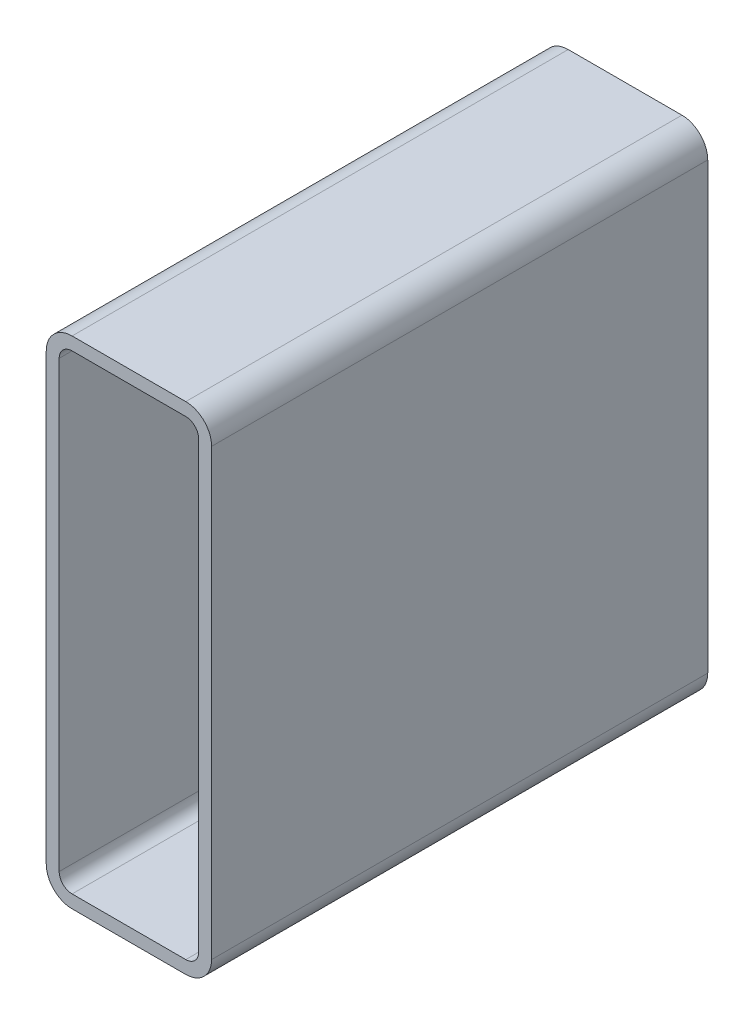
ISO-10303-21;
HEADER;
FILE_DESCRIPTION(('STEP AP214'),'2;1');
FILE_NAME('part.step','',(''),(''),'','','');
FILE_SCHEMA(('AUTOMOTIVE_DESIGN { 1 0 10303 214 1 1 1 1 }'));
ENDSEC;
DATA;
#1=APPLICATION_CONTEXT('core data for automotive mechanical design processes');
#2=APPLICATION_PROTOCOL_DEFINITION('international standard','automotive_design',2000,#1);
#3=PRODUCT_CONTEXT('',#1,'mechanical');
#4=PRODUCT('Part','Part','',(#3));
#5=PRODUCT_RELATED_PRODUCT_CATEGORY('part','',(#4));
#6=PRODUCT_DEFINITION_FORMATION('','',#4);
#7=PRODUCT_DEFINITION_CONTEXT('part definition',#1,'design');
#8=PRODUCT_DEFINITION('design','',#6,#7);
#9=PRODUCT_DEFINITION_SHAPE('','',#8);
#10=(LENGTH_UNIT() NAMED_UNIT(*) SI_UNIT(.MILLI.,.METRE.));
#11=(NAMED_UNIT(*) PLANE_ANGLE_UNIT() SI_UNIT($,.RADIAN.));
#12=(NAMED_UNIT(*) SI_UNIT($,.STERADIAN.) SOLID_ANGLE_UNIT());
#13=UNCERTAINTY_MEASURE_WITH_UNIT(LENGTH_MEASURE(1.E-05),#10,'distance_accuracy_value','');
#14=(GEOMETRIC_REPRESENTATION_CONTEXT(3) GLOBAL_UNCERTAINTY_ASSIGNED_CONTEXT((#13)) GLOBAL_UNIT_ASSIGNED_CONTEXT((#10,
#11,#12)) REPRESENTATION_CONTEXT('',''));
#15=CARTESIAN_POINT('',(0.,0.,0.));
#16=DIRECTION('',(0.,0.,1.));
#17=DIRECTION('',(1.,0.,0.));
#18=AXIS2_PLACEMENT_3D('',#15,#16,#17);
#19=CARTESIAN_POINT('',(17.5501778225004,290.799496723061,304.8));
#20=DIRECTION('',(0.,0.,1.));
#21=DIRECTION('',(1.,0.,0.));
#22=AXIS2_PLACEMENT_3D('',#19,#20,#21);
#23=PLANE('',#22);
#24=CARTESIAN_POINT('',(17.5501778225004,290.799496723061,304.8));
#25=DIRECTION('',(0.,0.,1.));
#26=DIRECTION('',(1.,0.,0.));
#27=AXIS2_PLACEMENT_3D('',#24,#25,#26);
#28=CIRCLE('',#27,15.875);
#29=CARTESIAN_POINT('',(17.5501778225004,306.674496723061,304.8));
#30=VERTEX_POINT('',#29);
#31=CARTESIAN_POINT('',(1.67517782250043,290.799496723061,304.8));
#32=VERTEX_POINT('',#31);
#33=EDGE_CURVE('E211',#30,#32,#28,.T.);
#34=ORIENTED_EDGE('',*,*,#33,.T.);
#35=DIRECTION('',(0.,-1.,0.));
#36=VECTOR('',#35,1.);
#37=CARTESIAN_POINT('',(1.67517782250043,17.7494967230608,304.8));
#38=LINE('',#37,#36);
#39=CARTESIAN_POINT('',(1.67517782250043,17.7494967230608,304.8));
#40=VERTEX_POINT('',#39);
#41=EDGE_CURVE('E214',#32,#40,#38,.T.);
#42=ORIENTED_EDGE('',*,*,#41,.T.);
#43=CARTESIAN_POINT('',(17.5501778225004,17.7494967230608,304.8));
#44=DIRECTION('',(0.,0.,1.));
#45=DIRECTION('',(1.,0.,0.));
#46=AXIS2_PLACEMENT_3D('',#43,#44,#45);
#47=CIRCLE('',#46,15.875);
#48=CARTESIAN_POINT('',(17.5501778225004,1.87449672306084,304.8));
#49=VERTEX_POINT('',#48);
#50=EDGE_CURVE('E217',#40,#49,#47,.T.);
#51=ORIENTED_EDGE('',*,*,#50,.T.);
#52=DIRECTION('',(1.,0.,0.));
#53=VECTOR('',#52,1.);
#54=CARTESIAN_POINT('',(87.4001778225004,1.87449672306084,304.8));
#55=LINE('',#54,#53);
#56=CARTESIAN_POINT('',(87.4001778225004,1.87449672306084,304.8));
#57=VERTEX_POINT('',#56);
#58=EDGE_CURVE('E219',#49,#57,#55,.T.);
#59=ORIENTED_EDGE('',*,*,#58,.T.);
#60=CARTESIAN_POINT('',(87.4001778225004,17.7494967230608,304.8));
#61=DIRECTION('',(0.,0.,1.));
#62=DIRECTION('',(1.,0.,0.));
#63=AXIS2_PLACEMENT_3D('',#60,#61,#62);
#64=CIRCLE('',#63,15.875);
#65=CARTESIAN_POINT('',(103.2751778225,17.7494967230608,304.8));
#66=VERTEX_POINT('',#65);
#67=EDGE_CURVE('E221',#57,#66,#64,.T.);
#68=ORIENTED_EDGE('',*,*,#67,.T.);
#69=DIRECTION('',(0.,1.,0.));
#70=VECTOR('',#69,1.);
#71=CARTESIAN_POINT('',(103.2751778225,290.799496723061,304.8));
#72=LINE('',#71,#70);
#73=CARTESIAN_POINT('',(103.2751778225,290.799496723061,304.8));
#74=VERTEX_POINT('',#73);
#75=EDGE_CURVE('E223',#66,#74,#72,.T.);
#76=ORIENTED_EDGE('',*,*,#75,.T.);
#77=CARTESIAN_POINT('',(87.4001778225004,290.799496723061,304.8));
#78=DIRECTION('',(0.,0.,1.));
#79=DIRECTION('',(1.,0.,0.));
#80=AXIS2_PLACEMENT_3D('',#77,#78,#79);
#81=CIRCLE('',#80,15.875);
#82=CARTESIAN_POINT('',(87.4001778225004,306.674496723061,304.8));
#83=VERTEX_POINT('',#82);
#84=EDGE_CURVE('E225',#74,#83,#81,.T.);
#85=ORIENTED_EDGE('',*,*,#84,.T.);
#86=DIRECTION('',(-1.,0.,0.));
#87=VECTOR('',#86,1.);
#88=CARTESIAN_POINT('',(17.5501778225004,306.674496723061,304.8));
#89=LINE('',#88,#87);
#90=EDGE_CURVE('E227',#83,#30,#89,.T.);
#91=ORIENTED_EDGE('',*,*,#90,.T.);
#92=EDGE_LOOP('',(#34,#42,#51,#59,#68,#76,#85,#91));
#93=FACE_BOUND('',#92,.T.);
#94=DIRECTION('',(0.,-1.,0.));
#95=VECTOR('',#94,1.);
#96=CARTESIAN_POINT('',(9.61267782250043,17.7494967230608,304.8));
#97=LINE('',#96,#95);
#98=CARTESIAN_POINT('',(9.61267782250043,290.799496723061,304.8));
#99=VERTEX_POINT('',#98);
#100=CARTESIAN_POINT('',(9.61267782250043,17.7494967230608,304.8));
#101=VERTEX_POINT('',#100);
#102=EDGE_CURVE('E154',#99,#101,#97,.T.);
#103=ORIENTED_EDGE('',*,*,#102,.F.);
#104=CARTESIAN_POINT('',(17.5501778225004,290.799496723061,304.8));
#105=DIRECTION('',(0.,0.,1.));
#106=DIRECTION('',(1.,0.,0.));
#107=AXIS2_PLACEMENT_3D('',#104,#105,#106);
#108=CIRCLE('',#107,7.9375);
#109=CARTESIAN_POINT('',(17.5501778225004,298.736996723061,304.8));
#110=VERTEX_POINT('',#109);
#111=EDGE_CURVE('E146',#110,#99,#108,.T.);
#112=ORIENTED_EDGE('',*,*,#111,.F.);
#113=DIRECTION('',(-1.,0.,0.));
#114=VECTOR('',#113,1.);
#115=CARTESIAN_POINT('',(17.5501778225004,298.736996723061,304.8));
#116=LINE('',#115,#114);
#117=CARTESIAN_POINT('',(87.4001778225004,298.736996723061,304.8));
#118=VERTEX_POINT('',#117);
#119=EDGE_CURVE('E179',#118,#110,#116,.T.);
#120=ORIENTED_EDGE('',*,*,#119,.F.);
#121=CARTESIAN_POINT('',(87.4001778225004,290.799496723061,304.8));
#122=DIRECTION('',(0.,0.,1.));
#123=DIRECTION('',(1.,0.,0.));
#124=AXIS2_PLACEMENT_3D('',#121,#122,#123);
#125=CIRCLE('',#124,7.93749999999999);
#126=CARTESIAN_POINT('',(95.3376778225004,290.799496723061,304.8));
#127=VERTEX_POINT('',#126);
#128=EDGE_CURVE('E177',#127,#118,#125,.T.);
#129=ORIENTED_EDGE('',*,*,#128,.F.);
#130=DIRECTION('',(0.,1.,0.));
#131=VECTOR('',#130,1.);
#132=CARTESIAN_POINT('',(95.3376778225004,290.799496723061,304.8));
#133=LINE('',#132,#131);
#134=CARTESIAN_POINT('',(95.3376778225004,17.7494967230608,304.8));
#135=VERTEX_POINT('',#134);
#136=EDGE_CURVE('E175',#135,#127,#133,.T.);
#137=ORIENTED_EDGE('',*,*,#136,.F.);
#138=CARTESIAN_POINT('',(87.4001778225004,17.7494967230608,304.8));
#139=DIRECTION('',(0.,0.,1.));
#140=DIRECTION('',(1.,0.,0.));
#141=AXIS2_PLACEMENT_3D('',#138,#139,#140);
#142=CIRCLE('',#141,7.9375);
#143=CARTESIAN_POINT('',(87.4001778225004,9.81199672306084,304.8));
#144=VERTEX_POINT('',#143);
#145=EDGE_CURVE('E173',#144,#135,#142,.T.);
#146=ORIENTED_EDGE('',*,*,#145,.F.);
#147=DIRECTION('',(1.,0.,0.));
#148=VECTOR('',#147,1.);
#149=CARTESIAN_POINT('',(87.4001778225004,9.81199672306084,304.8));
#150=LINE('',#149,#148);
#151=CARTESIAN_POINT('',(17.5501778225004,9.81199672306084,304.8));
#152=VERTEX_POINT('',#151);
#153=EDGE_CURVE('E169',#152,#144,#150,.T.);
#154=ORIENTED_EDGE('',*,*,#153,.F.);
#155=CARTESIAN_POINT('',(17.5501778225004,17.7494967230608,304.8));
#156=DIRECTION('',(0.,0.,1.));
#157=DIRECTION('',(1.,0.,0.));
#158=AXIS2_PLACEMENT_3D('',#155,#156,#157);
#159=CIRCLE('',#158,7.9375);
#160=EDGE_CURVE('E167',#101,#152,#159,.T.);
#161=ORIENTED_EDGE('',*,*,#160,.F.);
#162=EDGE_LOOP('',(#103,#112,#120,#129,#137,#146,#154,#161));
#163=FACE_BOUND('',#162,.T.);
#164=ADVANCED_FACE('F33',(#93,#163),#23,.T.);
#165=CARTESIAN_POINT('',(17.5501778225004,290.799496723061,0.));
#166=DIRECTION('',(0.,0.,1.));
#167=DIRECTION('',(1.,0.,0.));
#168=AXIS2_PLACEMENT_3D('',#165,#166,#167);
#169=PLANE('',#168);
#170=CARTESIAN_POINT('',(17.5501778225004,290.799496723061,0.));
#171=DIRECTION('',(0.,0.,1.));
#172=DIRECTION('',(1.,0.,0.));
#173=AXIS2_PLACEMENT_3D('',#170,#171,#172);
#174=CIRCLE('',#173,15.875);
#175=CARTESIAN_POINT('',(17.5501778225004,306.674496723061,0.));
#176=VERTEX_POINT('',#175);
#177=CARTESIAN_POINT('',(1.67517782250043,290.799496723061,0.));
#178=VERTEX_POINT('',#177);
#179=EDGE_CURVE('E162',#176,#178,#174,.T.);
#180=ORIENTED_EDGE('',*,*,#179,.F.);
#181=DIRECTION('',(-1.,0.,0.));
#182=VECTOR('',#181,1.);
#183=CARTESIAN_POINT('',(17.5501778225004,306.674496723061,0.));
#184=LINE('',#183,#182);
#185=CARTESIAN_POINT('',(87.4001778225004,306.674496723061,0.));
#186=VERTEX_POINT('',#185);
#187=EDGE_CURVE('E215',#186,#176,#184,.T.);
#188=ORIENTED_EDGE('',*,*,#187,.F.);
#189=CARTESIAN_POINT('',(87.4001778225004,290.799496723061,0.));
#190=DIRECTION('',(0.,0.,1.));
#191=DIRECTION('',(1.,0.,0.));
#192=AXIS2_PLACEMENT_3D('',#189,#190,#191);
#193=CIRCLE('',#192,15.875);
#194=CARTESIAN_POINT('',(103.2751778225,290.799496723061,0.));
#195=VERTEX_POINT('',#194);
#196=EDGE_CURVE('E242',#195,#186,#193,.T.);
#197=ORIENTED_EDGE('',*,*,#196,.F.);
#198=DIRECTION('',(0.,1.,0.));
#199=VECTOR('',#198,1.);
#200=CARTESIAN_POINT('',(103.2751778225,290.799496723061,0.));
#201=LINE('',#200,#199);
#202=CARTESIAN_POINT('',(103.2751778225,17.7494967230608,0.));
#203=VERTEX_POINT('',#202);
#204=EDGE_CURVE('E240',#203,#195,#201,.T.);
#205=ORIENTED_EDGE('',*,*,#204,.F.);
#206=CARTESIAN_POINT('',(87.4001778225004,17.7494967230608,0.));
#207=DIRECTION('',(0.,0.,1.));
#208=DIRECTION('',(1.,0.,0.));
#209=AXIS2_PLACEMENT_3D('',#206,#207,#208);
#210=CIRCLE('',#209,15.875);
#211=CARTESIAN_POINT('',(87.4001778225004,1.87449672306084,0.));
#212=VERTEX_POINT('',#211);
#213=EDGE_CURVE('E238',#212,#203,#210,.T.);
#214=ORIENTED_EDGE('',*,*,#213,.F.);
#215=DIRECTION('',(1.,0.,0.));
#216=VECTOR('',#215,1.);
#217=CARTESIAN_POINT('',(87.4001778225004,1.87449672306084,0.));
#218=LINE('',#217,#216);
#219=CARTESIAN_POINT('',(17.5501778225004,1.87449672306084,0.));
#220=VERTEX_POINT('',#219);
#221=EDGE_CURVE('E236',#220,#212,#218,.T.);
#222=ORIENTED_EDGE('',*,*,#221,.F.);
#223=CARTESIAN_POINT('',(17.5501778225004,17.7494967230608,0.));
#224=DIRECTION('',(0.,0.,1.));
#225=DIRECTION('',(1.,0.,0.));
#226=AXIS2_PLACEMENT_3D('',#223,#224,#225);
#227=CIRCLE('',#226,15.875);
#228=CARTESIAN_POINT('',(1.67517782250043,17.7494967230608,0.));
#229=VERTEX_POINT('',#228);
#230=EDGE_CURVE('E234',#229,#220,#227,.T.);
#231=ORIENTED_EDGE('',*,*,#230,.F.);
#232=DIRECTION('',(0.,-1.,0.));
#233=VECTOR('',#232,1.);
#234=CARTESIAN_POINT('',(1.67517782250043,17.7494967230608,0.));
#235=LINE('',#234,#233);
#236=EDGE_CURVE('E232',#178,#229,#235,.T.);
#237=ORIENTED_EDGE('',*,*,#236,.F.);
#238=EDGE_LOOP('',(#180,#188,#197,#205,#214,#222,#231,#237));
#239=FACE_BOUND('',#238,.T.);
#240=CARTESIAN_POINT('',(17.5501778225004,290.799496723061,0.));
#241=DIRECTION('',(0.,0.,1.));
#242=DIRECTION('',(1.,0.,0.));
#243=AXIS2_PLACEMENT_3D('',#240,#241,#242);
#244=CIRCLE('',#243,7.9375);
#245=CARTESIAN_POINT('',(17.5501778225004,298.736996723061,0.));
#246=VERTEX_POINT('',#245);
#247=CARTESIAN_POINT('',(9.61267782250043,290.799496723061,0.));
#248=VERTEX_POINT('',#247);
#249=EDGE_CURVE('E56',#246,#248,#244,.T.);
#250=ORIENTED_EDGE('',*,*,#249,.T.);
#251=DIRECTION('',(0.,-1.,0.));
#252=VECTOR('',#251,1.);
#253=CARTESIAN_POINT('',(9.61267782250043,17.7494967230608,0.));
#254=LINE('',#253,#252);
#255=CARTESIAN_POINT('',(9.61267782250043,17.7494967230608,0.));
#256=VERTEX_POINT('',#255);
#257=EDGE_CURVE('E161',#248,#256,#254,.T.);
#258=ORIENTED_EDGE('',*,*,#257,.T.);
#259=CARTESIAN_POINT('',(17.5501778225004,17.7494967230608,0.));
#260=DIRECTION('',(0.,0.,1.));
#261=DIRECTION('',(1.,0.,0.));
#262=AXIS2_PLACEMENT_3D('',#259,#260,#261);
#263=CIRCLE('',#262,7.9375);
#264=CARTESIAN_POINT('',(17.5501778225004,9.81199672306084,0.));
#265=VERTEX_POINT('',#264);
#266=EDGE_CURVE('E183',#256,#265,#263,.T.);
#267=ORIENTED_EDGE('',*,*,#266,.T.);
#268=DIRECTION('',(1.,0.,0.));
#269=VECTOR('',#268,1.);
#270=CARTESIAN_POINT('',(87.4001778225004,9.81199672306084,0.));
#271=LINE('',#270,#269);
#272=CARTESIAN_POINT('',(87.4001778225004,9.81199672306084,0.));
#273=VERTEX_POINT('',#272);
#274=EDGE_CURVE('E186',#265,#273,#271,.T.);
#275=ORIENTED_EDGE('',*,*,#274,.T.);
#276=CARTESIAN_POINT('',(87.4001778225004,17.7494967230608,0.));
#277=DIRECTION('',(0.,0.,1.));
#278=DIRECTION('',(1.,0.,0.));
#279=AXIS2_PLACEMENT_3D('',#276,#277,#278);
#280=CIRCLE('',#279,7.9375);
#281=CARTESIAN_POINT('',(95.3376778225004,17.7494967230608,0.));
#282=VERTEX_POINT('',#281);
#283=EDGE_CURVE('E189',#273,#282,#280,.T.);
#284=ORIENTED_EDGE('',*,*,#283,.T.);
#285=DIRECTION('',(0.,1.,0.));
#286=VECTOR('',#285,1.);
#287=CARTESIAN_POINT('',(95.3376778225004,290.799496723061,0.));
#288=LINE('',#287,#286);
#289=CARTESIAN_POINT('',(95.3376778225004,290.799496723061,0.));
#290=VERTEX_POINT('',#289);
#291=EDGE_CURVE('E192',#282,#290,#288,.T.);
#292=ORIENTED_EDGE('',*,*,#291,.T.);
#293=CARTESIAN_POINT('',(87.4001778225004,290.799496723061,0.));
#294=DIRECTION('',(0.,0.,1.));
#295=DIRECTION('',(1.,0.,0.));
#296=AXIS2_PLACEMENT_3D('',#293,#294,#295);
#297=CIRCLE('',#296,7.93749999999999);
#298=CARTESIAN_POINT('',(87.4001778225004,298.736996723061,0.));
#299=VERTEX_POINT('',#298);
#300=EDGE_CURVE('E195',#290,#299,#297,.T.);
#301=ORIENTED_EDGE('',*,*,#300,.T.);
#302=DIRECTION('',(-1.,0.,0.));
#303=VECTOR('',#302,1.);
#304=CARTESIAN_POINT('',(17.5501778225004,298.736996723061,0.));
#305=LINE('',#304,#303);
#306=EDGE_CURVE('E155',#299,#246,#305,.T.);
#307=ORIENTED_EDGE('',*,*,#306,.T.);
#308=EDGE_LOOP('',(#250,#258,#267,#275,#284,#292,#301,#307));
#309=FACE_BOUND('',#308,.T.);
#310=ADVANCED_FACE('F272',(#239,#309),#169,.F.);
#311=CARTESIAN_POINT('',(17.5501778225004,290.799496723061,304.8));
#312=DIRECTION('',(0.,0.,-1.));
#313=DIRECTION('',(-1.,0.,0.));
#314=AXIS2_PLACEMENT_3D('',#311,#312,#313);
#315=CYLINDRICAL_SURFACE('',#314,15.875);
#316=ORIENTED_EDGE('',*,*,#179,.T.);
#317=DIRECTION('',(0.,0.,-1.));
#318=VECTOR('',#317,1.);
#319=CARTESIAN_POINT('',(1.67517782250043,290.799496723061,304.8));
#320=LINE('',#319,#318);
#321=EDGE_CURVE('E11',#32,#178,#320,.T.);
#322=ORIENTED_EDGE('',*,*,#321,.F.);
#323=ORIENTED_EDGE('',*,*,#33,.F.);
#324=DIRECTION('',(0.,0.,-1.));
#325=VECTOR('',#324,1.);
#326=CARTESIAN_POINT('',(17.5501778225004,306.674496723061,304.8));
#327=LINE('',#326,#325);
#328=EDGE_CURVE('E229',#30,#176,#327,.T.);
#329=ORIENTED_EDGE('',*,*,#328,.T.);
#330=EDGE_LOOP('',(#316,#322,#323,#329));
#331=FACE_BOUND('',#330,.T.);
#332=ADVANCED_FACE('F35',(#331),#315,.T.);
#333=CARTESIAN_POINT('',(1.67517782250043,17.7494967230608,304.8));
#334=DIRECTION('',(1.,0.,0.));
#335=DIRECTION('',(0.,0.,-1.));
#336=AXIS2_PLACEMENT_3D('',#333,#334,#335);
#337=PLANE('',#336);
#338=ORIENTED_EDGE('',*,*,#236,.T.);
#339=DIRECTION('',(0.,0.,-1.));
#340=VECTOR('',#339,1.);
#341=CARTESIAN_POINT('',(1.67517782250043,17.7494967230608,304.8));
#342=LINE('',#341,#340);
#343=EDGE_CURVE('E41',#40,#229,#342,.T.);
#344=ORIENTED_EDGE('',*,*,#343,.F.);
#345=ORIENTED_EDGE('',*,*,#41,.F.);
#346=ORIENTED_EDGE('',*,*,#321,.T.);
#347=EDGE_LOOP('',(#338,#344,#345,#346));
#348=FACE_BOUND('',#347,.T.);
#349=ADVANCED_FACE('F289',(#348),#337,.F.);
#350=CARTESIAN_POINT('',(17.5501778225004,17.7494967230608,304.8));
#351=DIRECTION('',(0.,0.,-1.));
#352=DIRECTION('',(-1.,0.,0.));
#353=AXIS2_PLACEMENT_3D('',#350,#351,#352);
#354=CYLINDRICAL_SURFACE('',#353,15.875);
#355=ORIENTED_EDGE('',*,*,#230,.T.);
#356=DIRECTION('',(0.,0.,-1.));
#357=VECTOR('',#356,1.);
#358=CARTESIAN_POINT('',(17.5501778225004,1.87449672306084,304.8));
#359=LINE('',#358,#357);
#360=EDGE_CURVE('E259',#49,#220,#359,.T.);
#361=ORIENTED_EDGE('',*,*,#360,.F.);
#362=ORIENTED_EDGE('',*,*,#50,.F.);
#363=ORIENTED_EDGE('',*,*,#343,.T.);
#364=EDGE_LOOP('',(#355,#361,#362,#363));
#365=FACE_BOUND('',#364,.T.);
#366=ADVANCED_FACE('F266',(#365),#354,.T.);
#367=CARTESIAN_POINT('',(87.4001778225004,1.87449672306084,304.8));
#368=DIRECTION('',(0.,1.,0.));
#369=DIRECTION('',(0.,0.,1.));
#370=AXIS2_PLACEMENT_3D('',#367,#368,#369);
#371=PLANE('',#370);
#372=ORIENTED_EDGE('',*,*,#221,.T.);
#373=DIRECTION('',(0.,0.,-1.));
#374=VECTOR('',#373,1.);
#375=CARTESIAN_POINT('',(87.4001778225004,1.87449672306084,304.8));
#376=LINE('',#375,#374);
#377=EDGE_CURVE('E256',#57,#212,#376,.T.);
#378=ORIENTED_EDGE('',*,*,#377,.F.);
#379=ORIENTED_EDGE('',*,*,#58,.F.);
#380=ORIENTED_EDGE('',*,*,#360,.T.);
#381=EDGE_LOOP('',(#372,#378,#379,#380));
#382=FACE_BOUND('',#381,.T.);
#383=ADVANCED_FACE('F278',(#382),#371,.F.);
#384=CARTESIAN_POINT('',(87.4001778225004,17.7494967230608,304.8));
#385=DIRECTION('',(0.,0.,-1.));
#386=DIRECTION('',(-1.,0.,0.));
#387=AXIS2_PLACEMENT_3D('',#384,#385,#386);
#388=CYLINDRICAL_SURFACE('',#387,15.875);
#389=ORIENTED_EDGE('',*,*,#213,.T.);
#390=DIRECTION('',(0.,0.,-1.));
#391=VECTOR('',#390,1.);
#392=CARTESIAN_POINT('',(103.2751778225,17.7494967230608,304.8));
#393=LINE('',#392,#391);
#394=EDGE_CURVE('E253',#66,#203,#393,.T.);
#395=ORIENTED_EDGE('',*,*,#394,.F.);
#396=ORIENTED_EDGE('',*,*,#67,.F.);
#397=ORIENTED_EDGE('',*,*,#377,.T.);
#398=EDGE_LOOP('',(#389,#395,#396,#397));
#399=FACE_BOUND('',#398,.T.);
#400=ADVANCED_FACE('F282',(#399),#388,.T.);
#401=CARTESIAN_POINT('',(103.2751778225,290.799496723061,304.8));
#402=DIRECTION('',(-1.,0.,0.));
#403=DIRECTION('',(0.,0.,1.));
#404=AXIS2_PLACEMENT_3D('',#401,#402,#403);
#405=PLANE('',#404);
#406=ORIENTED_EDGE('',*,*,#204,.T.);
#407=DIRECTION('',(0.,0.,-1.));
#408=VECTOR('',#407,1.);
#409=CARTESIAN_POINT('',(103.2751778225,290.799496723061,304.8));
#410=LINE('',#409,#408);
#411=EDGE_CURVE('E250',#74,#195,#410,.T.);
#412=ORIENTED_EDGE('',*,*,#411,.F.);
#413=ORIENTED_EDGE('',*,*,#75,.F.);
#414=ORIENTED_EDGE('',*,*,#394,.T.);
#415=EDGE_LOOP('',(#406,#412,#413,#414));
#416=FACE_BOUND('',#415,.T.);
#417=ADVANCED_FACE('F302',(#416),#405,.F.);
#418=CARTESIAN_POINT('',(87.4001778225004,290.799496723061,304.8));
#419=DIRECTION('',(0.,0.,-1.));
#420=DIRECTION('',(-1.,0.,0.));
#421=AXIS2_PLACEMENT_3D('',#418,#419,#420);
#422=CYLINDRICAL_SURFACE('',#421,15.875);
#423=ORIENTED_EDGE('',*,*,#196,.T.);
#424=DIRECTION('',(0.,0.,-1.));
#425=VECTOR('',#424,1.);
#426=CARTESIAN_POINT('',(87.4001778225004,306.674496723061,304.8));
#427=LINE('',#426,#425);
#428=EDGE_CURVE('E247',#83,#186,#427,.T.);
#429=ORIENTED_EDGE('',*,*,#428,.F.);
#430=ORIENTED_EDGE('',*,*,#84,.F.);
#431=ORIENTED_EDGE('',*,*,#411,.T.);
#432=EDGE_LOOP('',(#423,#429,#430,#431));
#433=FACE_BOUND('',#432,.T.);
#434=ADVANCED_FACE('F300',(#433),#422,.T.);
#435=CARTESIAN_POINT('',(17.5501778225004,306.674496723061,304.8));
#436=DIRECTION('',(0.,-1.,0.));
#437=DIRECTION('',(0.,0.,-1.));
#438=AXIS2_PLACEMENT_3D('',#435,#436,#437);
#439=PLANE('',#438);
#440=ORIENTED_EDGE('',*,*,#187,.T.);
#441=ORIENTED_EDGE('',*,*,#328,.F.);
#442=ORIENTED_EDGE('',*,*,#90,.F.);
#443=ORIENTED_EDGE('',*,*,#428,.T.);
#444=EDGE_LOOP('',(#440,#441,#442,#443));
#445=FACE_BOUND('',#444,.T.);
#446=ADVANCED_FACE('F295',(#445),#439,.F.);
#447=CARTESIAN_POINT('',(17.5501778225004,290.799496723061,304.8));
#448=DIRECTION('',(0.,0.,-1.));
#449=DIRECTION('',(-1.,0.,0.));
#450=AXIS2_PLACEMENT_3D('',#447,#448,#449);
#451=CYLINDRICAL_SURFACE('',#450,7.9375);
#452=ORIENTED_EDGE('',*,*,#249,.F.);
#453=DIRECTION('',(0.,0.,-1.));
#454=VECTOR('',#453,1.);
#455=CARTESIAN_POINT('',(17.5501778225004,298.736996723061,304.8));
#456=LINE('',#455,#454);
#457=EDGE_CURVE('E150',#110,#246,#456,.T.);
#458=ORIENTED_EDGE('',*,*,#457,.F.);
#459=ORIENTED_EDGE('',*,*,#111,.T.);
#460=DIRECTION('',(0.,0.,-1.));
#461=VECTOR('',#460,1.);
#462=CARTESIAN_POINT('',(9.61267782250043,290.799496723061,304.8));
#463=LINE('',#462,#461);
#464=EDGE_CURVE('E149',#99,#248,#463,.T.);
#465=ORIENTED_EDGE('',*,*,#464,.T.);
#466=EDGE_LOOP('',(#452,#458,#459,#465));
#467=FACE_BOUND('',#466,.T.);
#468=ADVANCED_FACE('F148',(#467),#451,.F.);
#469=CARTESIAN_POINT('',(9.61267782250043,17.7494967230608,304.8));
#470=DIRECTION('',(1.,0.,0.));
#471=DIRECTION('',(0.,0.,-1.));
#472=AXIS2_PLACEMENT_3D('',#469,#470,#471);
#473=PLANE('',#472);
#474=ORIENTED_EDGE('',*,*,#257,.F.);
#475=ORIENTED_EDGE('',*,*,#464,.F.);
#476=ORIENTED_EDGE('',*,*,#102,.T.);
#477=DIRECTION('',(0.,0.,-1.));
#478=VECTOR('',#477,1.);
#479=CARTESIAN_POINT('',(9.61267782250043,17.7494967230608,304.8));
#480=LINE('',#479,#478);
#481=EDGE_CURVE('E163',#101,#256,#480,.T.);
#482=ORIENTED_EDGE('',*,*,#481,.T.);
#483=EDGE_LOOP('',(#474,#475,#476,#482));
#484=FACE_BOUND('',#483,.T.);
#485=ADVANCED_FACE('F158',(#484),#473,.T.);
#486=CARTESIAN_POINT('',(17.5501778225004,17.7494967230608,304.8));
#487=DIRECTION('',(0.,0.,-1.));
#488=DIRECTION('',(-1.,0.,0.));
#489=AXIS2_PLACEMENT_3D('',#486,#487,#488);
#490=CYLINDRICAL_SURFACE('',#489,7.9375);
#491=ORIENTED_EDGE('',*,*,#266,.F.);
#492=ORIENTED_EDGE('',*,*,#481,.F.);
#493=ORIENTED_EDGE('',*,*,#160,.T.);
#494=DIRECTION('',(0.,0.,-1.));
#495=VECTOR('',#494,1.);
#496=CARTESIAN_POINT('',(17.5501778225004,9.81199672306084,304.8));
#497=LINE('',#496,#495);
#498=EDGE_CURVE('E208',#152,#265,#497,.T.);
#499=ORIENTED_EDGE('',*,*,#498,.T.);
#500=EDGE_LOOP('',(#491,#492,#493,#499));
#501=FACE_BOUND('',#500,.T.);
#502=ADVANCED_FACE('F327',(#501),#490,.F.);
#503=CARTESIAN_POINT('',(87.4001778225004,9.81199672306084,304.8));
#504=DIRECTION('',(0.,1.,0.));
#505=DIRECTION('',(0.,0.,1.));
#506=AXIS2_PLACEMENT_3D('',#503,#504,#505);
#507=PLANE('',#506);
#508=ORIENTED_EDGE('',*,*,#274,.F.);
#509=ORIENTED_EDGE('',*,*,#498,.F.);
#510=ORIENTED_EDGE('',*,*,#153,.T.);
#511=DIRECTION('',(0.,0.,-1.));
#512=VECTOR('',#511,1.);
#513=CARTESIAN_POINT('',(87.4001778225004,9.81199672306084,304.8));
#514=LINE('',#513,#512);
#515=EDGE_CURVE('E206',#144,#273,#514,.T.);
#516=ORIENTED_EDGE('',*,*,#515,.T.);
#517=EDGE_LOOP('',(#508,#509,#510,#516));
#518=FACE_BOUND('',#517,.T.);
#519=ADVANCED_FACE('F331',(#518),#507,.T.);
#520=CARTESIAN_POINT('',(87.4001778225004,17.7494967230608,304.8));
#521=DIRECTION('',(0.,0.,-1.));
#522=DIRECTION('',(-1.,0.,0.));
#523=AXIS2_PLACEMENT_3D('',#520,#521,#522);
#524=CYLINDRICAL_SURFACE('',#523,7.9375);
#525=ORIENTED_EDGE('',*,*,#283,.F.);
#526=ORIENTED_EDGE('',*,*,#515,.F.);
#527=ORIENTED_EDGE('',*,*,#145,.T.);
#528=DIRECTION('',(0.,0.,-1.));
#529=VECTOR('',#528,1.);
#530=CARTESIAN_POINT('',(95.3376778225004,17.7494967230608,304.8));
#531=LINE('',#530,#529);
#532=EDGE_CURVE('E204',#135,#282,#531,.T.);
#533=ORIENTED_EDGE('',*,*,#532,.T.);
#534=EDGE_LOOP('',(#525,#526,#527,#533));
#535=FACE_BOUND('',#534,.T.);
#536=ADVANCED_FACE('F337',(#535),#524,.F.);
#537=CARTESIAN_POINT('',(95.3376778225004,290.799496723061,304.8));
#538=DIRECTION('',(-1.,0.,0.));
#539=DIRECTION('',(0.,0.,1.));
#540=AXIS2_PLACEMENT_3D('',#537,#538,#539);
#541=PLANE('',#540);
#542=ORIENTED_EDGE('',*,*,#291,.F.);
#543=ORIENTED_EDGE('',*,*,#532,.F.);
#544=ORIENTED_EDGE('',*,*,#136,.T.);
#545=DIRECTION('',(0.,0.,-1.));
#546=VECTOR('',#545,1.);
#547=CARTESIAN_POINT('',(95.3376778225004,290.799496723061,304.8));
#548=LINE('',#547,#546);
#549=EDGE_CURVE('E202',#127,#290,#548,.T.);
#550=ORIENTED_EDGE('',*,*,#549,.T.);
#551=EDGE_LOOP('',(#542,#543,#544,#550));
#552=FACE_BOUND('',#551,.T.);
#553=ADVANCED_FACE('F341',(#552),#541,.T.);
#554=CARTESIAN_POINT('',(87.4001778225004,290.799496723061,304.8));
#555=DIRECTION('',(0.,0.,-1.));
#556=DIRECTION('',(-1.,0.,0.));
#557=AXIS2_PLACEMENT_3D('',#554,#555,#556);
#558=CYLINDRICAL_SURFACE('',#557,7.93749999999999);
#559=ORIENTED_EDGE('',*,*,#300,.F.);
#560=ORIENTED_EDGE('',*,*,#549,.F.);
#561=ORIENTED_EDGE('',*,*,#128,.T.);
#562=DIRECTION('',(0.,0.,-1.));
#563=VECTOR('',#562,1.);
#564=CARTESIAN_POINT('',(87.4001778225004,298.736996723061,304.8));
#565=LINE('',#564,#563);
#566=EDGE_CURVE('E48',#118,#299,#565,.T.);
#567=ORIENTED_EDGE('',*,*,#566,.T.);
#568=EDGE_LOOP('',(#559,#560,#561,#567));
#569=FACE_BOUND('',#568,.T.);
#570=ADVANCED_FACE('F345',(#569),#558,.F.);
#571=CARTESIAN_POINT('',(17.5501778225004,298.736996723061,304.8));
#572=DIRECTION('',(0.,-1.,0.));
#573=DIRECTION('',(0.,0.,-1.));
#574=AXIS2_PLACEMENT_3D('',#571,#572,#573);
#575=PLANE('',#574);
#576=ORIENTED_EDGE('',*,*,#306,.F.);
#577=ORIENTED_EDGE('',*,*,#566,.F.);
#578=ORIENTED_EDGE('',*,*,#119,.T.);
#579=ORIENTED_EDGE('',*,*,#457,.T.);
#580=EDGE_LOOP('',(#576,#577,#578,#579));
#581=FACE_BOUND('',#580,.T.);
#582=ADVANCED_FACE('F349',(#581),#575,.T.);
#583=CLOSED_SHELL('',(#164,#310,#332,#349,#366,#383,#400,#417,#434,#446,#468,#485,#502,#519,
#536,#553,#570,#582));
#584=MANIFOLD_SOLID_BREP('B2',#583);
#585=ADVANCED_BREP_SHAPE_REPRESENTATION('',(#18,#584),#14);
#586=SHAPE_DEFINITION_REPRESENTATION(#9,#585);
ENDSEC;
END-ISO-10303-21;
